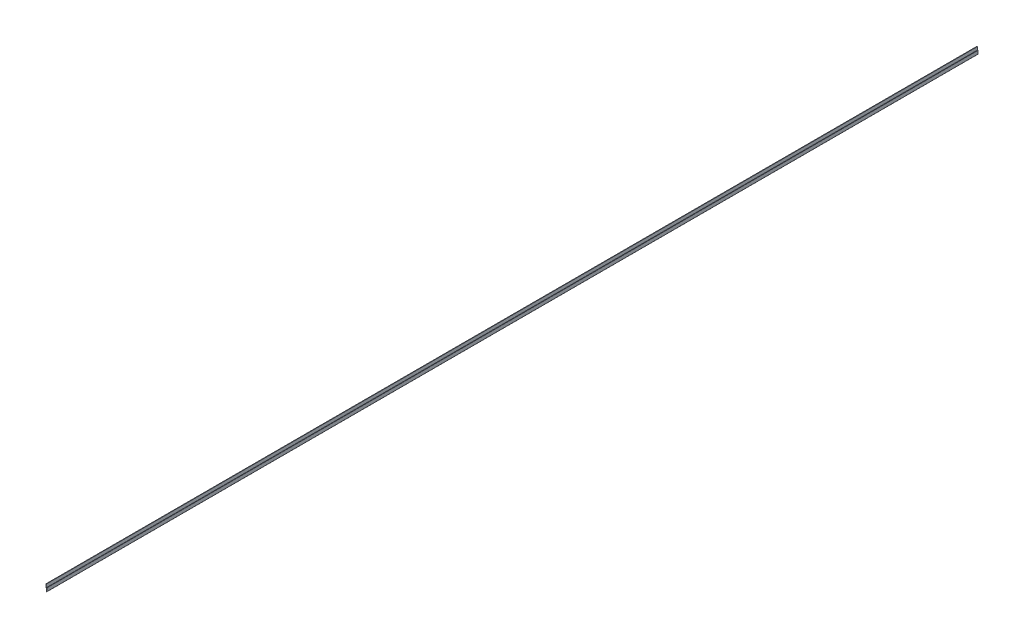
from build123d import *

# Parameters (mm, degrees)
EXTRUDE_THIN1_DEPTH = 3048


with BuildPart() as part:
    # Sketch1 → Extrude-Thin1 (new body)
    with BuildSketch(Plane.XY):
        with BuildLine():
            Line((0.721190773, 3.206713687), (1.341338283, 12.075236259))
            ThreePointArc((1.341338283, 12.075236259), (2.013557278, 12.664756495), (2.60892121, 11.997707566))
            Line((2.60892121, 11.997707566), (2.030607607, 0.962826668))
            ThreePointArc((2.030607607, 0.962826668), (0.989404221, 0.000348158), (0, 1.016))
            Line((0, 1.016), (0, 21.590015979))
            ThreePointArc((0, 21.590015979), (-0.124985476, 21.717), (-0.25393609, 21.59404452))
            Line((-0.25393609, 21.59404452), (-0.636648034, 9.535100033))
            Line((-0.636648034, 9.535100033), (-1.144392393, 9.551214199))
            Line((-1.144392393, 9.551214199), (-0.761680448, 21.610158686))
            ThreePointArc((-0.761680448, 21.610158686), (-0.116927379, 22.224936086), (0.508, 21.590015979))
            Line((0.508, 21.590015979), (0.508, 1.016))
            ThreePointArc((0.508, 1.016), (1.00270211, 0.508174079), (1.523303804, 0.989413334))
            Line((1.523303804, 0.989413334), (2.101617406, 12.024294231))
            ThreePointArc((2.101617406, 12.024294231), (1.98254462, 12.157704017), (1.848100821, 12.03979997))
            Line((1.848100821, 12.03979997), (1.227953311, 3.171277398))
            Line((1.227953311, 3.171277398), (0.721190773, 3.206713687))
        make_face()
    extrude(amount=EXTRUDE_THIN1_DEPTH)


solid = part.part
